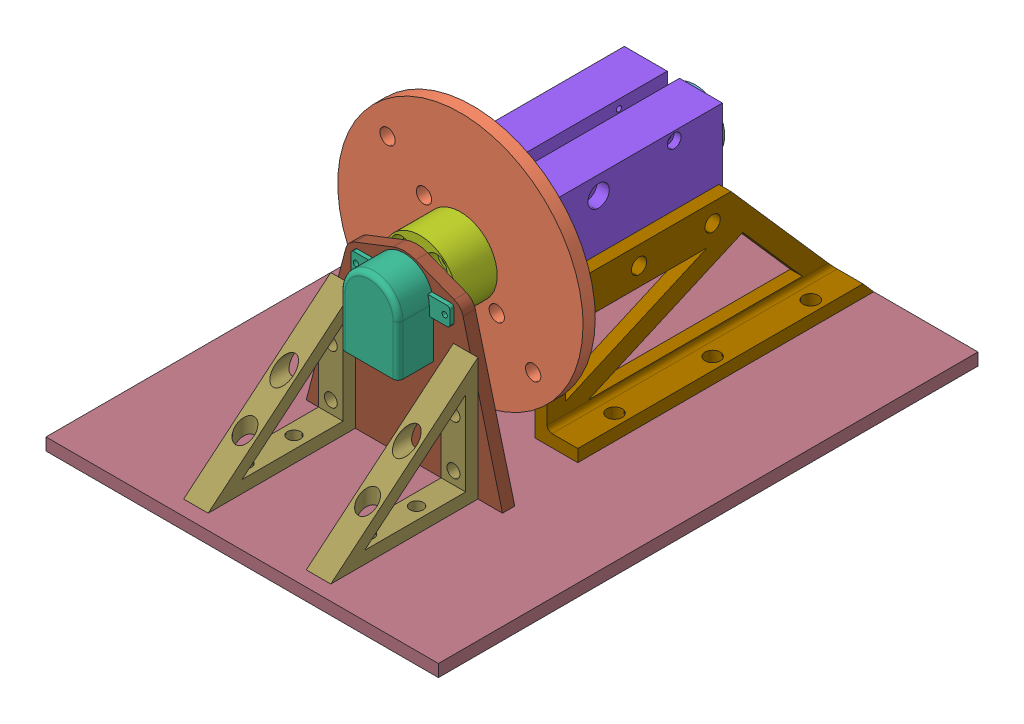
SolidWorks assembly Main Assembly Motor Demo.SLDASM, configuration Default (file format 7000). Lengths in mm.
Overall size (203.2 149.2 279.4).
15 component instances, 13 part files, 36 mates.
Components (placement in the parent):
- Motor-1: Motor.SLDPRT [Default] at (28.9312 42.0528 45.3344) size (33.5 33.5 67.6)
- Disk-1: Disk.SLDPRT [Default] at (28.9312 42.0528 143.6719) x (0.998706 0.050863 0) z (0 0 1) size (127 127 6.35)
- Motor Coupling-1: Motor Coupling.SLDPRT [Default] at (28.9312 42.0528 104.9844) x (-0.923728 -0.383049 0) z (0 0 -1) size (12.27 12.27 19.05)
- Bearing McMaster 60355K440-1: Bearing McMaster 60355K440.SLDPRT [60355K44] at (28.9312 42.0528 108.5562) size (19.05 19.05 7.14)
- Bearing McMaster 60355K440-2: Bearing McMaster 60355K440.SLDPRT [60355K44] at (28.9312 42.0528 135.2) size (19.05 19.05 7.14)
- Washer thick-1: Washer thick.SLDPRT [Default] at (28.9312 42.0528 143.6719) x (-0.923728 -0.383049 0) z (0 0 -1) size (12.7 12.7 4.9)
- Encoder-1: Encoder.SLDPRT [Default] at (28.9312 42.0528 179.0219) size (51.2 41.1 18.3)
- Encoder Hub-1: Encoder Hub.SLDPRT [Default] at (28.9312 42.0528 150.0219) x (0.742157 -0.670226 0) z (0 0 1) size (38.1 38.1 42)
- Transmission-1: Transmission.SLDPRT [Default] at (3.5312 16.6528 39.7119) size (50.8 50.8 99.06)
- Stand Left-1: Stand Left.SLDPRT [Default] at (54.3312 -34.1472 136.8669) x (0 0 -1) z (1 0 0) size (153.28 66.04 22.23)
- Stand Right-1: Stand Right.SLDPRT [Default] at (-2.8188 -34.1472 136.8669) x (0 0 -1) z (1 0 0) size (153.28 66.04 22.23)
- Encoder Plate-1: Encoder Plate.SLDPRT [Default] at (28.9312 42.0528 172.6719) size (101.6 92.2 6.35)
- Encoder Plate Support-1: Encoder Plate Support.SLDPRT [Default] at (67.0312 -34.1472 179.0219) x (0 0 1) z (-1 0 0) size (76.2 63.5 12.7)
- Encoder Plate Support-2: Encoder Plate Support.SLDPRT [Default] at (3.5312 -34.1472 179.0219) x (0 0 1) z (-1 0 0) size (76.2 63.5 12.7)
- Base Plate-1: Base Plate.SLDPRT [Default] at (130.5312 -34.1472 262.9898) x (-1 0 0) z (0 -1 0) size (203.2 279.4 6.35)
Mates (geometry in assembly coordinates):
- Concentric1: concentric aligned: cylinder of Motor-1 through (28.9312 42.0528 93.3344) axis (0 0 -1) radius 1.585; cylinder of Motor Coupling-1 through (28.9312 42.0528 104.9844) axis (0 0 -1) radius 1.53
- Distance1: distance = 2 mm anti-aligned: plane of Motor Coupling-1 through (28.9312 42.0528 85.9344) normal (0 0 -1); plane of Motor-1 through (28.9312 42.0528 83.9344) normal (0 0 1)
- Concentric2: concentric aligned: cylinder of Disk-1 through (28.9312 42.0528 143.6719) axis (0 0 1) radius 3.9688; cylinder of Motor Coupling-1 through (28.9312 42.0528 85.9344) axis (0 0 1) radius 6.1341
- Concentric3: concentric aligned: cylinder of Motor Coupling-1 through (28.9312 42.0528 104.9844) axis (0 0 1) radius 2.5527; cylinder of Bearing McMaster 60355K440-1 through (28.9312 42.0528 112.1281) axis (0 0 1) radius 3.175
- Concentric4: concentric aligned: cylinder of Motor Coupling-1 through (28.9312 42.0528 104.9844) axis (0 0 1) radius 2.5527; cylinder of Bearing McMaster 60355K440-2 through (28.9312 42.0528 138.7719) axis (0 0 1) radius 3.175
- Coincident3: coincident anti-aligned: plane of Motor Coupling-1 through (28.9312 42.0528 104.9844) normal (0 0 1); plane of Bearing McMaster 60355K440-1 through (28.9312 45.5849 104.9844) normal (0 0 -1)
- Coincident4: coincident anti-aligned: plane of Disk-1 through (28.9312 42.0528 143.6719) normal (0 0 -1); plane of Washer thick-1 through (28.9312 42.0528 143.6719) normal (0 0 1)
- Concentric5: concentric aligned: cylinder of Disk-1 through (28.9312 42.0528 143.6719) axis (0 0 1) radius 3.9688; cylinder of Washer thick-1 through (28.9312 42.0528 138.7719) axis (0 0 1) radius 3.3782
- Coincident5: coincident anti-aligned: plane of Bearing McMaster 60355K440-2 through (28.9312 47.8794 138.7719) normal (0 0 1); plane of Washer thick-1 through (28.9312 42.0528 138.7719) normal (0 0 -1)
- Distance2: distance = 19.5 mm anti-aligned: plane of Bearing McMaster 60355K440-2 through (28.9312 51.2206 131.6281) normal (0 0 -1); plane of Bearing McMaster 60355K440-1 through (28.9312 51.2206 112.1281) normal (0 0 1)
- Coincident8: coincident anti-aligned: plane of Disk-1 through (28.9312 42.0528 150.0219) normal (0 0 1); plane of Encoder Hub-1 through (28.9312 42.0528 150.0219) normal (0 0 -1)
- Concentric6: concentric anti-aligned: cylinder of Disk-1 through (28.9312 42.0528 143.6719) axis (0 0 1) radius 3.9688; cylinder of Encoder Hub-1 through (28.9312 42.0528 192.0219) axis (0 0 -1) radius 3.175
- Concentric8: concentric anti-aligned: cylinder of Disk-1 through (37.443 51.4781 143.6719) axis (0 0 1) radius 3.9688; cylinder of Encoder Hub-1 through (37.443 51.4781 171.0219) axis (0 0 -1) radius 3.9688
- Concentric10: concentric aligned: cylinder of Encoder-1 through (28.9312 42.0528 193.0219) axis (0 0 -1) radius 4; cylinder of Encoder Hub-1 through (28.9312 42.0528 192.0219) axis (0 0 -1) radius 3.175
- Distance5: distance = 8 mm anti-aligned: plane of Encoder Hub-1 through (28.9312 42.0528 171.0219) normal (0 0 1); plane of Encoder-1 through (28.9312 42.0528 179.0219) normal (0 0 -1)
- Parallel5: parallel aligned: plane of Encoder-1 through (43.9312 42.0528 197.3219) normal (1 0 0); plane of assembly through (0 0 0) normal (1 0 0)
- Concentric11: concentric aligned: cylinder of Motor-1 through (28.9312 42.0528 75.3344) axis (0 0 -1) radius 16.75; cylinder of Transmission-1 through (28.9312 42.0528 82.8919) axis (0 0 -1) radius 16.75
- Coincident17: coincident aligned: circle of Bearing McMaster 60355K440-2; plane of Transmission-1 through (3.5312 16.6528 138.7719) normal (0 0 1)
- Coincident19: coincident anti-aligned: plane of Transmission-1 through (54.3312 16.6528 138.7719) normal (1 0 0); plane of Stand Left-1 through (54.3312 -34.1472 136.8669) normal (-1 0 0)
- Concentric12: concentric anti-aligned: cylinder of Transmission-1 through (54.3312 22.3678 127.3419) axis (1 0 0) radius 2.5527; cylinder of Stand Left-1 through (60.6812 22.3678 127.3419) axis (-1 0 0) radius 3.9688
- Parallel6: parallel aligned: plane of Transmission-1 through (3.5312 67.4528 138.7719) normal (0 1 0); plane of Stand Left-1 through (60.6812 31.8928 136.8669) normal (0 1 0)
- Concentric14: concentric aligned: cylinder of Transmission-1 through (3.5312 22.3678 127.3419) axis (-1 0 0) radius 2.5527; cylinder of Stand Right-1 through (3.5312 22.3678 127.3419) axis (-1 0 0) radius 3.9688
- Coincident23: coincident anti-aligned: plane of Transmission-1 through (3.5312 16.6528 138.7719) normal (-1 0 0); plane of Stand Right-1 through (3.5312 -34.1472 136.8669) normal (1 0 0)
- Parallel8: parallel aligned: plane of Transmission-1 through (3.5312 67.4528 138.7719) normal (0 1 0); plane of Stand Right-1 through (3.5312 31.8928 136.8669) normal (0 1 0)
- Coincident25: coincident anti-aligned: plane of Encoder-1 through (28.9312 42.0528 179.0219) normal (0 0 -1); plane of Encoder Plate-1 through (28.9312 42.0528 179.0219) normal (0 0 1)
- Parallel9: parallel aligned: plane of Encoder-1 through (13.9312 15.9528 197.3219) normal (0 -1 0); plane of Encoder Plate-1 through (-21.8688 -34.1472 179.0219) normal (0 -1 0)
- Concentric15: concentric aligned: cylinder of Encoder-1 through (5.9312 42.0528 181.1219) axis (0 0 -1) radius 1.37; cylinder of Encoder Plate-1 through (5.9312 42.0528 172.6719) axis (0 0 -1) radius 1.025
- Coincident27: coincident anti-aligned: plane of Encoder Plate-1 through (28.9312 42.0528 179.0219) normal (0 0 1); plane of Encoder Plate Support-1 through (54.3312 -34.1472 179.0219) normal (0 0 -1)
- Coincident28: coincident aligned: plane of Encoder Plate-1 through (-21.8688 -34.1472 179.0219) normal (0 -1 0); plane of Encoder Plate Support-1 through (54.3312 -34.1472 255.2219) normal (0 -1 0)
- Concentric16: concentric aligned: cylinder of Encoder Plate-1 through (60.6812 3.9528 179.0219) axis (0 0 1) radius 2.5527; cylinder of Encoder Plate Support-1 through (60.6812 3.9528 185.3719) axis (0 0 1) radius 3.3782
- Concentric17: concentric aligned: cylinder of Encoder Plate-1 through (-2.8188 3.9528 179.0219) axis (0 0 1) radius 2.5527; cylinder of Encoder Plate Support-2 through (-2.8188 3.9528 185.3719) axis (0 0 1) radius 3.3782
- Coincident29: coincident anti-aligned: plane of Encoder Plate-1 through (28.9312 42.0528 179.0219) normal (0 0 1); plane of Encoder Plate Support-2 through (-9.1688 -34.1472 179.0219) normal (0 0 -1)
- Parallel10: parallel aligned: plane of Encoder Plate-1 through (-21.8688 -34.1472 179.0219) normal (0 -1 0); plane of Encoder Plate Support-2 through (-9.1688 -34.1472 255.2219) normal (0 -1 0)
- Coincident33: coincident anti-aligned: plane of Stand Left-1 through (60.6812 -34.1472 -16.4102) normal (0 -1 0); plane of Base Plate-1 through (130.5312 -34.1472 262.9898) normal (0 1 0)
- Concentric18: concentric anti-aligned: cylinder of Stand Right-1 through (-12.3438 -27.7972 9.8669) axis (0 -1 0) radius 3.9688; cylinder of Base Plate-1 through (-12.3438 -34.1472 9.8669) axis (0 1 0) radius 2.5527
- Concentric19: concentric anti-aligned: cylinder of Stand Left-1 through (70.2062 -27.7972 9.8669) axis (0 -1 0) radius 3.9688; cylinder of Base Plate-1 through (70.2062 -34.1472 9.8669) axis (0 1 0) radius 2.5527
